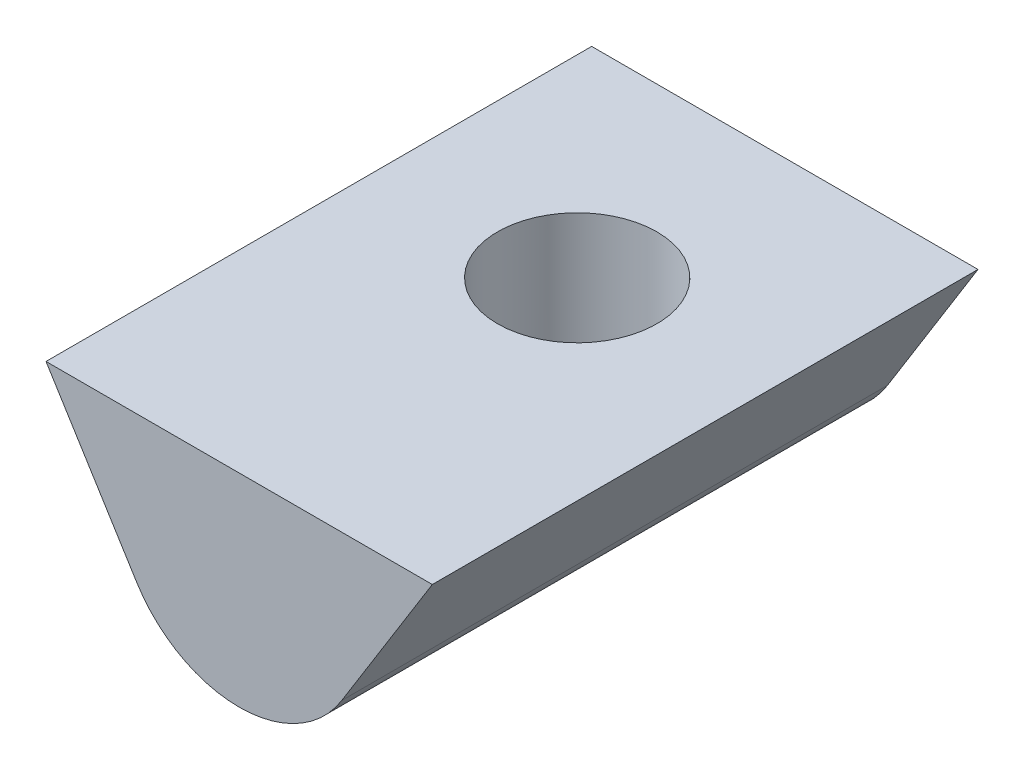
ISO-10303-21;
HEADER;
FILE_DESCRIPTION(('STEP AP214'),'2;1');
FILE_NAME('part.step','',(''),(''),'','','');
FILE_SCHEMA(('AUTOMOTIVE_DESIGN { 1 0 10303 214 1 1 1 1 }'));
ENDSEC;
DATA;
#1=APPLICATION_CONTEXT('core data for automotive mechanical design processes');
#2=APPLICATION_PROTOCOL_DEFINITION('international standard','automotive_design',2000,#1);
#3=PRODUCT_CONTEXT('',#1,'mechanical');
#4=PRODUCT('Part','Part','',(#3));
#5=PRODUCT_RELATED_PRODUCT_CATEGORY('part','',(#4));
#6=PRODUCT_DEFINITION_FORMATION('','',#4);
#7=PRODUCT_DEFINITION_CONTEXT('part definition',#1,'design');
#8=PRODUCT_DEFINITION('design','',#6,#7);
#9=PRODUCT_DEFINITION_SHAPE('','',#8);
#10=(LENGTH_UNIT() NAMED_UNIT(*) SI_UNIT(.MILLI.,.METRE.));
#11=(NAMED_UNIT(*) PLANE_ANGLE_UNIT() SI_UNIT($,.RADIAN.));
#12=(NAMED_UNIT(*) SI_UNIT($,.STERADIAN.) SOLID_ANGLE_UNIT());
#13=UNCERTAINTY_MEASURE_WITH_UNIT(LENGTH_MEASURE(1.E-05),#10,'distance_accuracy_value','');
#14=(GEOMETRIC_REPRESENTATION_CONTEXT(3) GLOBAL_UNCERTAINTY_ASSIGNED_CONTEXT((#13)) GLOBAL_UNIT_ASSIGNED_CONTEXT((#10,
#11,#12)) REPRESENTATION_CONTEXT('',''));
#15=CARTESIAN_POINT('',(0.,0.,0.));
#16=DIRECTION('',(0.,0.,1.));
#17=DIRECTION('',(1.,0.,0.));
#18=AXIS2_PLACEMENT_3D('',#15,#16,#17);
#19=CARTESIAN_POINT('',(0.,0.,11.3000000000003));
#20=DIRECTION('',(0.849336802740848,0.5278513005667,0.));
#21=DIRECTION('',(-0.527851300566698,0.849336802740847,0.));
#22=AXIS2_PLACEMENT_3D('',#19,#20,#21);
#23=PLANE('',#22);
#24=DIRECTION('',(0.527851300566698,-0.849336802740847,0.));
#25=VECTOR('',#24,1.);
#26=CARTESIAN_POINT('',(0.,0.,0.));
#27=LINE('',#26,#25);
#28=CARTESIAN_POINT('',(0.,0.,0.));
#29=VERTEX_POINT('',#28);
#30=CARTESIAN_POINT('',(1.87665799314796,-3.01962825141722,0.));
#31=VERTEX_POINT('',#30);
#32=EDGE_CURVE('E103',#29,#31,#27,.T.);
#33=ORIENTED_EDGE('',*,*,#32,.T.);
#34=DIRECTION('',(0.,0.,-1.));
#35=VECTOR('',#34,1.);
#36=CARTESIAN_POINT('',(1.87665799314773,-3.01962825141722,11.3000000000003));
#37=LINE('',#36,#35);
#38=CARTESIAN_POINT('',(1.87665799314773,-3.01962825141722,11.3000000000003));
#39=VERTEX_POINT('',#38);
#40=EDGE_CURVE('E86',#39,#31,#37,.T.);
#41=ORIENTED_EDGE('',*,*,#40,.F.);
#42=DIRECTION('',(0.527851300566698,-0.849336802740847,0.));
#43=VECTOR('',#42,1.);
#44=CARTESIAN_POINT('',(0.,0.,11.3000000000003));
#45=LINE('',#44,#43);
#46=CARTESIAN_POINT('',(0.,0.,11.3000000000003));
#47=VERTEX_POINT('',#46);
#48=EDGE_CURVE('E115',#47,#39,#45,.T.);
#49=ORIENTED_EDGE('',*,*,#48,.F.);
#50=DIRECTION('',(0.,0.,-1.));
#51=VECTOR('',#50,1.);
#52=CARTESIAN_POINT('',(0.,0.,11.3000000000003));
#53=LINE('',#52,#51);
#54=EDGE_CURVE('E124',#47,#29,#53,.T.);
#55=ORIENTED_EDGE('',*,*,#54,.T.);
#56=EDGE_LOOP('',(#33,#41,#49,#55));
#57=FACE_BOUND('',#56,.T.);
#58=ADVANCED_FACE('F38',(#57),#23,.F.);
#59=CARTESIAN_POINT('',(3.99999999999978,-1.69999999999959,11.3000000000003));
#60=DIRECTION('',(0.,0.,-1.));
#61=DIRECTION('',(-1.,0.,0.));
#62=AXIS2_PLACEMENT_3D('',#59,#60,#61);
#63=CYLINDRICAL_SURFACE('',#62,2.5);
#64=CARTESIAN_POINT('',(4.,-4.20000000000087,5.95000000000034));
#65=CARTESIAN_POINT('',(4.08305739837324,-4.19999873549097,5.94999873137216));
#66=CARTESIAN_POINT('',(4.166127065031,-4.1958240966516,5.94369332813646));
#67=CARTESIAN_POINT('',(4.32962756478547,-4.17953793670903,5.91885588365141));
#68=CARTESIAN_POINT('',(4.41005674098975,-4.1674215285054,5.90031631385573));
#69=CARTESIAN_POINT('',(4.56566679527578,-4.13645078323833,5.85213728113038));
#70=CARTESIAN_POINT('',(4.64087037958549,-4.1176281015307,5.82254993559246));
#71=CARTESIAN_POINT('',(4.78495095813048,-4.07476519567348,5.75352693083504));
#72=CARTESIAN_POINT('',(4.85382712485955,-4.05072429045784,5.71408998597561));
#73=CARTESIAN_POINT('',(4.98983686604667,-3.99695661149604,5.62286952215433));
#74=CARTESIAN_POINT('',(5.05633669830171,-3.96692168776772,5.57032656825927));
#75=CARTESIAN_POINT('',(5.18018285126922,-3.90498845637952,5.45618952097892));
#76=CARTESIAN_POINT('',(5.23751597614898,-3.87308755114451,5.39458262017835));
#77=CARTESIAN_POINT('',(5.35043149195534,-3.8050678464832,5.25302539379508));
#78=CARTESIAN_POINT('',(5.40438210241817,-3.76905676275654,5.17171133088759));
#79=CARTESIAN_POINT('',(5.49776993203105,-3.70249251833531,4.99912083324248));
#80=CARTESIAN_POINT('',(5.53723225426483,-3.67192996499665,4.90786198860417));
#81=CARTESIAN_POINT('',(5.59072490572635,-3.62884004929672,4.74413560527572));
#82=CARTESIAN_POINT('',(5.608795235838,-3.61365570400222,4.67369396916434));
#83=CARTESIAN_POINT('',(5.63553399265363,-3.59085843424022,4.52990185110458));
#84=CARTESIAN_POINT('',(5.64421813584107,-3.58323285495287,4.45655644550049));
#85=CARTESIAN_POINT('',(5.65164261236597,-3.57672751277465,4.3086766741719));
#86=CARTESIAN_POINT('',(5.65034498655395,-3.57788113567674,4.23413884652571));
#87=CARTESIAN_POINT('',(5.63781110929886,-3.5888189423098,4.08652353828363));
#88=CARTESIAN_POINT('',(5.62656646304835,-3.59861041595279,4.01344734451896));
#89=CARTESIAN_POINT('',(5.59550624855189,-3.62477146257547,3.8736324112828));
#90=CARTESIAN_POINT('',(5.57605424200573,-3.64086012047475,3.80675695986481));
#91=CARTESIAN_POINT('',(5.52947910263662,-3.67777008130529,3.67715045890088));
#92=CARTESIAN_POINT('',(5.50235345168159,-3.69859293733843,3.61442077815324));
#93=CARTESIAN_POINT('',(5.4349555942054,-3.74767344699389,3.48145090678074));
#94=CARTESIAN_POINT('',(5.3931365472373,-3.77658411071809,3.41223771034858));
#95=CARTESIAN_POINT('',(5.30024206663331,-3.83598181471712,3.28100806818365));
#96=CARTESIAN_POINT('',(5.24915529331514,-3.86647075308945,3.21900059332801));
#97=CARTESIAN_POINT('',(5.12681675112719,-3.93295257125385,3.09079581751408));
#98=CARTESIAN_POINT('',(5.053579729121,-3.96877919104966,3.02638563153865));
#99=CARTESIAN_POINT('',(4.89548514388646,-4.03569104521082,2.9106937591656));
#100=CARTESIAN_POINT('',(4.81063903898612,-4.06678089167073,2.85939926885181));
#101=CARTESIAN_POINT('',(4.64873942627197,-4.11553581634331,2.78076937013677));
#102=CARTESIAN_POINT('',(4.57344640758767,-4.13463913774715,2.75070429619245));
#103=CARTESIAN_POINT('',(4.41797605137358,-4.16608341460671,2.70174403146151));
#104=CARTESIAN_POINT('',(4.33780286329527,-4.17843002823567,2.68283949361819));
#105=CARTESIAN_POINT('',(4.17436675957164,-4.19526903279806,2.65714787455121));
#106=CARTESIAN_POINT('',(4.09109267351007,-4.19972950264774,2.65041003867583));
#107=CARTESIAN_POINT('',(3.92445452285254,-4.20024632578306,2.64962658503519));
#108=CARTESIAN_POINT('',(3.84109046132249,-4.19630295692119,2.65558054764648));
#109=CARTESIAN_POINT('',(3.68240900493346,-4.18094276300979,2.67899822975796));
#110=CARTESIAN_POINT('',(3.60692309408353,-4.17003481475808,2.69567875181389));
#111=CARTESIAN_POINT('',(3.46005990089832,-4.14214181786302,2.73896514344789));
#112=CARTESIAN_POINT('',(3.38868328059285,-4.12515579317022,2.76557260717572));
#113=CARTESIAN_POINT('',(3.24693809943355,-4.08509288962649,2.82968198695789));
#114=CARTESIAN_POINT('',(3.17693001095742,-4.06169438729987,2.86777480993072));
#115=CARTESIAN_POINT('',(3.04403755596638,-4.01110387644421,2.95282892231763));
#116=CARTESIAN_POINT('',(2.98115793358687,-3.98390936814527,2.99979606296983));
#117=CARTESIAN_POINT('',(2.85387161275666,-3.92308599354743,3.10961080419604));
#118=CARTESIAN_POINT('',(2.79077873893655,-3.88911767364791,3.17379416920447));
#119=CARTESIAN_POINT('',(2.67570206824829,-3.8214832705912,3.31166557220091));
#120=CARTESIAN_POINT('',(2.62372471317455,-3.78781737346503,3.38535908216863));
#121=CARTESIAN_POINT('',(2.53646359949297,-3.72745905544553,3.53370339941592));
#122=CARTESIAN_POINT('',(2.50003348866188,-3.70040607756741,3.6075295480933));
#123=CARTESIAN_POINT('',(2.43815286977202,-3.65247859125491,3.76149631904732));
#124=CARTESIAN_POINT('',(2.4126825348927,-3.63159294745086,3.84162522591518));
#125=CARTESIAN_POINT('',(2.37731800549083,-3.60193273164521,3.99279856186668));
#126=CARTESIAN_POINT('',(2.36552617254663,-3.59171317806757,4.06310833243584));
#127=CARTESIAN_POINT('',(2.35117171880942,-3.57921870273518,4.20533882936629));
#128=CARTESIAN_POINT('',(2.34860024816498,-3.57693616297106,4.27725794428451));
#129=CARTESIAN_POINT('',(2.35285074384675,-3.58066605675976,4.42059113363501));
#130=CARTESIAN_POINT('',(2.35967303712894,-3.58667877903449,4.49200519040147));
#131=CARTESIAN_POINT('',(2.38226056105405,-3.60607790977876,4.63240243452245));
#132=CARTESIAN_POINT('',(2.39803759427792,-3.61947404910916,4.70138228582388));
#133=CARTESIAN_POINT('',(2.44327638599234,-3.65644518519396,4.8541707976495));
#134=CARTESIAN_POINT('',(2.47532286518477,-3.68181441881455,4.9367723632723));
#135=CARTESIAN_POINT('',(2.55116703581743,-3.73791662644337,5.09439420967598));
#136=CARTESIAN_POINT('',(2.59498105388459,-3.76865703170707,5.16940375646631));
#137=CARTESIAN_POINT('',(2.69411024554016,-3.83264932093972,5.3123443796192));
#138=CARTESIAN_POINT('',(2.7496101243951,-3.86593528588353,5.38013166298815));
#139=CARTESIAN_POINT('',(2.87089712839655,-3.93156562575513,5.50635347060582));
#140=CARTESIAN_POINT('',(2.936687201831,-3.96390972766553,5.56478530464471));
#141=CARTESIAN_POINT('',(3.08677589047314,-4.02884485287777,5.67783171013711));
#142=CARTESIAN_POINT('',(3.17236208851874,-4.06095353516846,5.73103774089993));
#143=CARTESIAN_POINT('',(3.35395050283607,-4.11693780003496,5.82162979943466));
#144=CARTESIAN_POINT('',(3.44993287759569,-4.14082871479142,5.8590453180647));
#145=CARTESIAN_POINT('',(3.6219708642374,-4.17235569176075,5.90788092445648));
#146=CARTESIAN_POINT('',(3.69633525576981,-4.18264654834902,5.92360538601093));
#147=CARTESIAN_POINT('',(3.84713038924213,-4.19646746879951,5.94466271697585));
#148=CARTESIAN_POINT('',(3.92355999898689,-4.200001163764,5.95000116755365));
#149=CARTESIAN_POINT('',(4.,-4.20000000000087,5.95000000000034));
#150=B_SPLINE_CURVE_WITH_KNOTS('',3,(#64,#65,#66,#67,#68,#69,#70,#71,#72,#73,#74,#75,#76,#77,
#78,#79,#80,#81,#82,#83,#84,#85,#86,#87,#88,#89,#90,#91,#92,#93,#94,#95,#96,#97,#98,#99,#100,
#101,#102,#103,#104,#105,#106,#107,#108,#109,#110,#111,#112,#113,#114,#115,#116,#117,#118,#119,
#120,#121,#122,#123,#124,#125,#126,#127,#128,#129,#130,#131,#132,#133,#134,#135,#136,#137,#138,
#139,#140,#141,#142,#143,#144,#145,#146,#147,#148,#149),.UNSPECIFIED.,.T.,.F.,(4,2,2,2,2,2,2,2,
2,2,2,2,2,2,2,2,2,2,2,2,2,2,2,2,2,2,2,2,2,2,2,2,2,2,2,2,2,2,2,2,2,2,4),(0.,0.248863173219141,
0.497879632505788,0.745735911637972,0.993624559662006,1.26236142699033,1.53148173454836,
1.84208059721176,2.15213873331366,2.3741210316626,2.59573105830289,2.81818424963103,
3.04082536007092,3.25449658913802,3.46823801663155,3.72496879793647,3.98201585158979,
4.29224112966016,4.60216239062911,4.85099486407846,5.09961864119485,5.34924649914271,
5.59886610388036,5.83205917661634,6.06528971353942,6.31352952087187,6.56193357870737,
6.84938688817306,7.13700633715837,7.39601090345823,7.65454492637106,7.86965548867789,
8.08455952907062,8.29947104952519,8.5146664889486,8.78967221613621,9.06506148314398,
9.34518323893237,9.62538540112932,9.94089155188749,10.2558058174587,10.4849645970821,
10.7140001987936),.UNSPECIFIED.);
#151=CARTESIAN_POINT('',(4.,-4.20000000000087,2.64999999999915));
#152=VERTEX_POINT('',#151);
#153=CARTESIAN_POINT('',(4.,-4.20000000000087,5.95000000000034));
#154=VERTEX_POINT('',#153);
#155=EDGE_CURVE('E41',#152,#154,#150,.T.);
#156=ORIENTED_EDGE('',*,*,#155,.T.);
#157=EDGE_CURVE('E11',#154,#152,#150,.T.);
#158=ORIENTED_EDGE('',*,*,#157,.T.);
#159=EDGE_LOOP('',(#156,#158));
#160=FACE_BOUND('',#159,.T.);
#161=CARTESIAN_POINT('',(4.,-1.69999999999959,0.));
#162=DIRECTION('',(0.,0.,1.));
#163=DIRECTION('',(-1.,0.,0.));
#164=AXIS2_PLACEMENT_3D('',#161,#162,#163);
#165=CIRCLE('',#164,2.5);
#166=CARTESIAN_POINT('',(6.12334200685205,-3.01962825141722,0.));
#167=VERTEX_POINT('',#166);
#168=EDGE_CURVE('E93',#31,#167,#165,.T.);
#169=ORIENTED_EDGE('',*,*,#168,.T.);
#170=DIRECTION('',(0.,0.,-1.));
#171=VECTOR('',#170,1.);
#172=CARTESIAN_POINT('',(6.12334200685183,-3.01962825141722,11.3000000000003));
#173=LINE('',#172,#171);
#174=CARTESIAN_POINT('',(6.12334200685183,-3.01962825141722,11.3000000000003));
#175=VERTEX_POINT('',#174);
#176=EDGE_CURVE('E95',#175,#167,#173,.T.);
#177=ORIENTED_EDGE('',*,*,#176,.F.);
#178=CARTESIAN_POINT('',(3.99999999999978,-1.69999999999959,11.3000000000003));
#179=DIRECTION('',(0.,0.,1.));
#180=DIRECTION('',(-1.,0.,0.));
#181=AXIS2_PLACEMENT_3D('',#178,#179,#180);
#182=CIRCLE('',#181,2.5);
#183=EDGE_CURVE('E120',#39,#175,#182,.T.);
#184=ORIENTED_EDGE('',*,*,#183,.F.);
#185=ORIENTED_EDGE('',*,*,#40,.T.);
#186=EDGE_LOOP('',(#169,#177,#184,#185));
#187=FACE_BOUND('',#186,.T.);
#188=ADVANCED_FACE('F87',(#160,#187),#63,.T.);
#189=CARTESIAN_POINT('',(8.00000000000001,0.,11.2999999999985));
#190=DIRECTION('',(-0.849336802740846,0.527851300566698,0.));
#191=DIRECTION('',(-0.5278513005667,-0.849336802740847,0.));
#192=AXIS2_PLACEMENT_3D('',#189,#190,#191);
#193=PLANE('',#192);
#194=DIRECTION('',(0.5278513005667,0.849336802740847,0.));
#195=VECTOR('',#194,1.);
#196=CARTESIAN_POINT('',(8.00000000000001,0.,-1.77635683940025E-12));
#197=LINE('',#196,#195);
#198=CARTESIAN_POINT('',(8.00000000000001,0.,-1.77635683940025E-12));
#199=VERTEX_POINT('',#198);
#200=EDGE_CURVE('E102',#167,#199,#197,.T.);
#201=ORIENTED_EDGE('',*,*,#200,.T.);
#202=DIRECTION('',(0.,0.,-1.));
#203=VECTOR('',#202,1.);
#204=CARTESIAN_POINT('',(8.00000000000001,0.,11.2999999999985));
#205=LINE('',#204,#203);
#206=CARTESIAN_POINT('',(8.00000000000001,0.,11.2999999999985));
#207=VERTEX_POINT('',#206);
#208=EDGE_CURVE('E109',#207,#199,#205,.T.);
#209=ORIENTED_EDGE('',*,*,#208,.F.);
#210=DIRECTION('',(0.5278513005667,0.849336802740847,0.));
#211=VECTOR('',#210,1.);
#212=CARTESIAN_POINT('',(8.00000000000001,0.,11.2999999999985));
#213=LINE('',#212,#211);
#214=EDGE_CURVE('E108',#175,#207,#213,.T.);
#215=ORIENTED_EDGE('',*,*,#214,.F.);
#216=ORIENTED_EDGE('',*,*,#176,.T.);
#217=EDGE_LOOP('',(#201,#209,#215,#216));
#218=FACE_BOUND('',#217,.T.);
#219=ADVANCED_FACE('F90',(#218),#193,.F.);
#220=CARTESIAN_POINT('',(0.,0.,11.3000000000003));
#221=DIRECTION('',(0.,-1.,0.));
#222=DIRECTION('',(0.,0.,-1.));
#223=AXIS2_PLACEMENT_3D('',#220,#221,#222);
#224=PLANE('',#223);
#225=CARTESIAN_POINT('',(3.99999999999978,0.,4.30000000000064));
#226=DIRECTION('',(0.,1.,0.));
#227=DIRECTION('',(0.,0.,1.));
#228=AXIS2_PLACEMENT_3D('',#225,#226,#227);
#229=CIRCLE('',#228,1.65);
#230=CARTESIAN_POINT('',(3.99999999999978,0.,5.95000000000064));
#231=VERTEX_POINT('',#230);
#232=EDGE_CURVE('E204',#231,#231,#229,.T.);
#233=ORIENTED_EDGE('',*,*,#232,.F.);
#234=EDGE_LOOP('',(#233));
#235=FACE_BOUND('',#234,.T.);
#236=DIRECTION('',(-1.,0.,0.));
#237=VECTOR('',#236,1.);
#238=CARTESIAN_POINT('',(0.,0.,0.));
#239=LINE('',#238,#237);
#240=EDGE_CURVE('E113',#199,#29,#239,.T.);
#241=ORIENTED_EDGE('',*,*,#240,.T.);
#242=ORIENTED_EDGE('',*,*,#54,.F.);
#243=DIRECTION('',(-1.,0.,0.));
#244=VECTOR('',#243,1.);
#245=CARTESIAN_POINT('',(0.,0.,11.3000000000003));
#246=LINE('',#245,#244);
#247=EDGE_CURVE('E61',#207,#47,#246,.T.);
#248=ORIENTED_EDGE('',*,*,#247,.F.);
#249=ORIENTED_EDGE('',*,*,#208,.T.);
#250=EDGE_LOOP('',(#241,#242,#248,#249));
#251=FACE_BOUND('',#250,.T.);
#252=ADVANCED_FACE('F132',(#235,#251),#224,.F.);
#253=CARTESIAN_POINT('',(3.99999999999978,-1.69999999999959,11.3000000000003));
#254=DIRECTION('',(0.,0.,-1.));
#255=DIRECTION('',(-1.,0.,0.));
#256=AXIS2_PLACEMENT_3D('',#253,#254,#255);
#257=PLANE('',#256);
#258=ORIENTED_EDGE('',*,*,#48,.T.);
#259=ORIENTED_EDGE('',*,*,#183,.T.);
#260=ORIENTED_EDGE('',*,*,#214,.T.);
#261=ORIENTED_EDGE('',*,*,#247,.T.);
#262=EDGE_LOOP('',(#258,#259,#260,#261));
#263=FACE_BOUND('',#262,.T.);
#264=ADVANCED_FACE('F135',(#263),#257,.F.);
#265=CARTESIAN_POINT('',(4.,-1.69999999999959,0.));
#266=DIRECTION('',(0.,0.,-1.));
#267=DIRECTION('',(-1.,0.,0.));
#268=AXIS2_PLACEMENT_3D('',#265,#266,#267);
#269=PLANE('',#268);
#270=ORIENTED_EDGE('',*,*,#32,.F.);
#271=ORIENTED_EDGE('',*,*,#240,.F.);
#272=ORIENTED_EDGE('',*,*,#200,.F.);
#273=ORIENTED_EDGE('',*,*,#168,.F.);
#274=EDGE_LOOP('',(#270,#271,#272,#273));
#275=FACE_BOUND('',#274,.T.);
#276=ADVANCED_FACE('F112',(#275),#269,.T.);
#277=CARTESIAN_POINT('',(3.99999999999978,0.,4.30000000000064));
#278=DIRECTION('',(0.,1.,0.));
#279=DIRECTION('',(0.,0.,1.));
#280=AXIS2_PLACEMENT_3D('',#277,#278,#279);
#281=CYLINDRICAL_SURFACE('',#280,1.65);
#282=ORIENTED_EDGE('',*,*,#232,.T.);
#283=EDGE_LOOP('',(#282));
#284=FACE_BOUND('',#283,.T.);
#285=ORIENTED_EDGE('',*,*,#155,.F.);
#286=ORIENTED_EDGE('',*,*,#157,.F.);
#287=EDGE_LOOP('',(#285,#286));
#288=FACE_BOUND('',#287,.T.);
#289=ADVANCED_FACE('F84',(#284,#288),#281,.F.);
#290=CLOSED_SHELL('',(#58,#188,#219,#252,#264,#276,#289));
#291=MANIFOLD_SOLID_BREP('B2',#290);
#292=ADVANCED_BREP_SHAPE_REPRESENTATION('',(#18,#291),#14);
#293=SHAPE_DEFINITION_REPRESENTATION(#9,#292);
ENDSEC;
END-ISO-10303-21;
